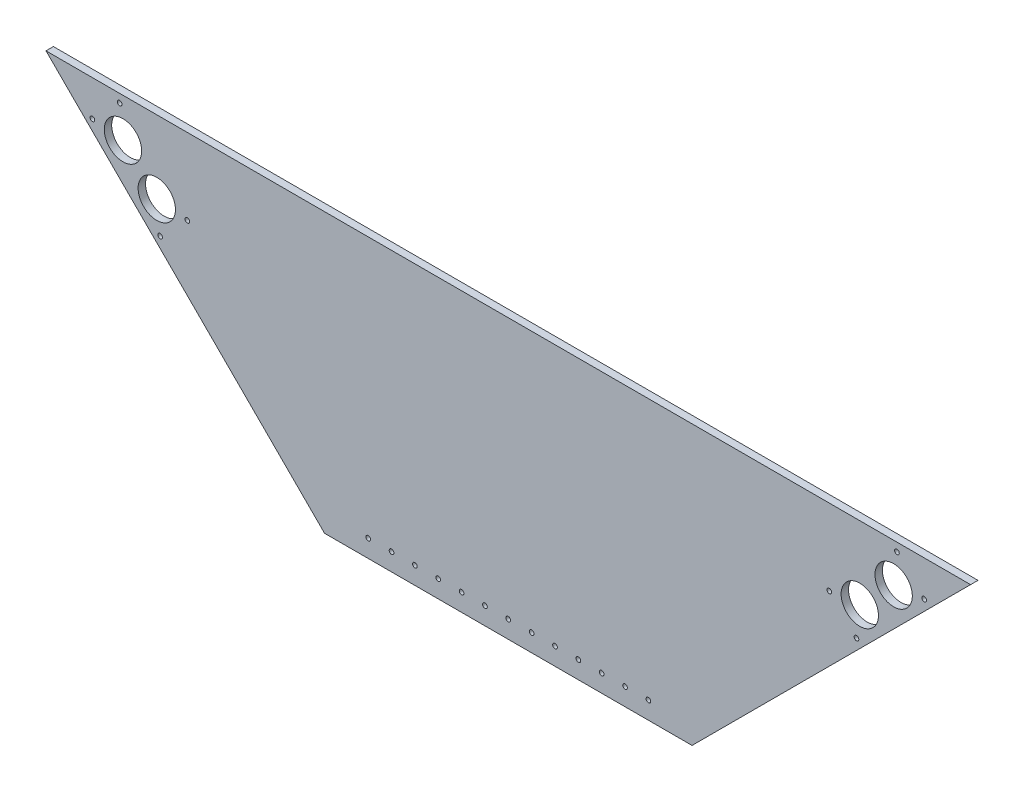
from build123d import *

# Parameters (mm, degrees)
BOSS_EXTRUDE1_DEPTH    = 3.175
POLE_MOUNTING_HOLES_R  = 1
CUT_EXTRUDE1_DEPTH     = 232.144846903
ROTATED_ULTRASONIC_R   = 8
ROTATED_ULTRASONIC_R_2 = 1
CUT_EXTRUDE2_DEPTH     = 232.144846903


with BuildPart() as part:
    # Sketch1 → Boss-Extrude1 (new body)
    with BuildSketch(Plane.XY):
        Polygon((-197.965, 119.28), (197.965, 119.28), (78.685, 0), (-78.685, 0), align=None)
    extrude(amount=BOSS_EXTRUDE1_DEPTH)

    # Pole Mounting Holes → Cut-Extrude1 (cut, through all)
    with BuildSketch(Plane.XY.offset(3.175)):
        with Locations((0, 7.5)):
            Circle(POLE_MOUNTING_HOLES_R)
        with Locations((10, 7.5)):
            Circle(POLE_MOUNTING_HOLES_R)
        with Locations((20, 7.5)):
            Circle(POLE_MOUNTING_HOLES_R)
        with Locations((30, 7.5)):
            Circle(POLE_MOUNTING_HOLES_R)
        with Locations((40, 7.5)):
            Circle(POLE_MOUNTING_HOLES_R)
        with Locations((50, 7.5)):
            Circle(POLE_MOUNTING_HOLES_R)
        with Locations((60, 7.5)):
            Circle(POLE_MOUNTING_HOLES_R)
        with Locations((-10, 7.5)):
            Circle(POLE_MOUNTING_HOLES_R)
        with Locations((-20, 7.5)):
            Circle(POLE_MOUNTING_HOLES_R)
        with Locations((-30, 7.5)):
            Circle(POLE_MOUNTING_HOLES_R)
        with Locations((-40, 7.5)):
            Circle(POLE_MOUNTING_HOLES_R)
        with Locations((-50, 7.5)):
            Circle(POLE_MOUNTING_HOLES_R)
        with Locations((-60, 7.5)):
            Circle(POLE_MOUNTING_HOLES_R)
    extrude(amount=-CUT_EXTRUDE1_DEPTH, mode=Mode.SUBTRACT)

    # Rotated Ultrasonic → Cut-Extrude2 (cut, through all)
    with BuildSketch(Plane.XY.offset(3.175)):
        with Locations((-165.014760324, 102.589016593)):
            Circle(ROTATED_ULTRASONIC_R)
        with Locations((-178.096235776, 104.003230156)):
            Circle(ROTATED_ULTRASONIC_R_2)
        with Locations((-166.428973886, 115.670492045)):
            Circle(ROTATED_ULTRASONIC_R_2)
        with Locations(Location((-137.437595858, 86.679114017, 0), (0, 0, 180))):
            Circle(ROTATED_ULTRASONIC_R_2)
        with Locations(Location((-149.104857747, 75.011852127, 0), (0, 0, 180))):
            Circle(ROTATED_ULTRASONIC_R_2)
        with Locations(Location((-150.51907131, 88.093327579, 0), (0, 0, 180))):
            Circle(ROTATED_ULTRASONIC_R)
    cut_extrude2 = extrude(amount=-CUT_EXTRUDE2_DEPTH, mode=Mode.SUBTRACT)

    # Mirror1: Cut-Extrude2 across plane
    add(cut_extrude2.mirror(Plane(origin=(0, 0, 0), x_dir=(0, 0, 1), z_dir=(1, 0, 0))), mode=Mode.SUBTRACT)


solid = part.part
